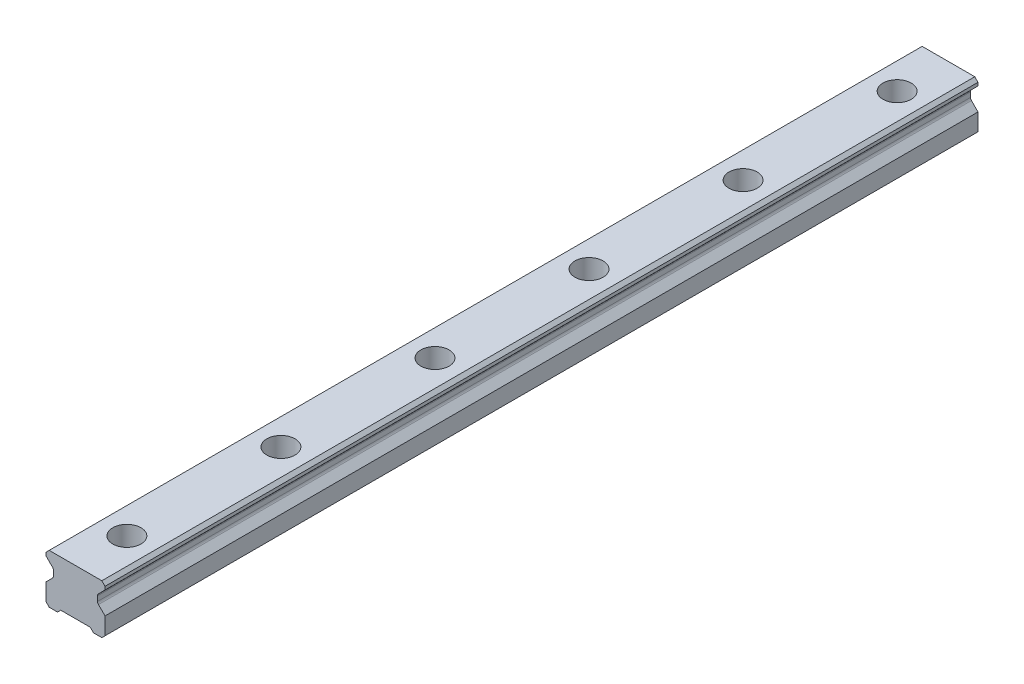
from build123d import *

# Parameters (mm, degrees)
SKETCH1_W           = 23
SKETCH1_H           = 19.2
BOSS_EXTRUDE1_DEPTH = 170
CUT_EXTRUDE1_DEPTH  = 341.735806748
CHAMFER1_SIZE       = 1.25
FILLET1_R           = 1.25
CUT_EXTRUDE2_DEPTH  = 341.735806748
SKETCH4_R           = 5.5
SKETCH4_R_2         = 3.5
CUT_EXTRUDE3_DEPTH  = 9
SKETCH4_2_R         = 3.5
CUT_EXTRUDE4_DEPTH  = 172.466877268
LPATTERN1_COUNT     = 6
LPATTERN1_PITCH     = 60


with BuildPart() as part:
    # Sketch1 → Boss-Extrude1 (new, symmetric)
    with BuildSketch(Plane.XY):
        with Locations((0, 9.6)):
            Rectangle(SKETCH1_W, SKETCH1_H)
    extrude(amount=BOSS_EXTRUDE1_DEPTH, both=True)

    # Sketch2 → Cut-Extrude1 (cut, through all)
    with BuildSketch(Plane.XY.offset(170)):
        Polygon((-11.5, 16.7), (-11.5, 7.95), (-8.583333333, 10.866666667), (-8.583333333, 13.783333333), align=None)
        Polygon((8.583333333, 13.783333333), (11.5, 16.7), (11.5, 7.95), (8.583333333, 10.866666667), align=None)
    extrude(amount=-CUT_EXTRUDE1_DEPTH, mode=Mode.SUBTRACT)

    # Chamfer1
    chamfer1_edges = [part.edges().sort_by_distance(p)[0] for p in [
        (-11.5, 19.2, 0),
        (11.5, 19.2, 0),
        (11.5, 0, 0),
        (-11.5, 0, 0),
    ]]
    chamfer(chamfer1_edges, length=CHAMFER1_SIZE)

    # Fillet1
    fillet1_edges = [part.edges().sort_by_distance(p)[0] for p in [
        (-8.583333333, 13.783333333, 0),
        (-8.583333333, 10.866666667, 0),
        (8.583333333, 10.866666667, 0),
        (8.583333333, 13.783333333, 0),
    ]]
    fillet(fillet1_edges, radius=FILLET1_R)

    # Sketch3 → Cut-Extrude2 (cut, through all)
    with BuildSketch(Plane.XY.offset(170)):
        Polygon((-7, 0), (-5.75, 1.25), (5.75, 1.25), (7, 0), align=None)
    extrude(amount=-CUT_EXTRUDE2_DEPTH, mode=Mode.SUBTRACT)

    # Sketch4 → Cut-Extrude3 (cut)
    with BuildSketch(Plane(origin=(0, 19.2, 0), x_dir=(1, 0, 0), z_dir=(0, 1, 0))):
        with Locations(Location((0, -150, 0), (0, 0, 270))):
            Circle(SKETCH4_R)
        with Locations(Location((0, -150, 0), (0, 0, 270))):
            Circle(SKETCH4_R_2, mode=Mode.SUBTRACT)
    cut_extrude3 = extrude(amount=-CUT_EXTRUDE3_DEPTH, mode=Mode.SUBTRACT)

    # Sketch4_2 → Cut-Extrude4 (cut, through all)
    with BuildSketch(Plane(origin=(0, 19.2, 0), x_dir=(1, 0, 0), z_dir=(0, 1, 0))):
        with Locations(Location((0, -150, 0), (0, 0, 270))):
            Circle(SKETCH4_2_R)
    cut_extrude4 = extrude(amount=-CUT_EXTRUDE4_DEPTH, mode=Mode.SUBTRACT)

    # LPattern1: Cut-Extrude3, Cut-Extrude4 ×6
    with Locations(*[(0, 0, -i * LPATTERN1_PITCH) for i in range(1, LPATTERN1_COUNT)]):
        add(cut_extrude3, mode=Mode.SUBTRACT)
        add(cut_extrude4, mode=Mode.SUBTRACT)


solid = part.part
